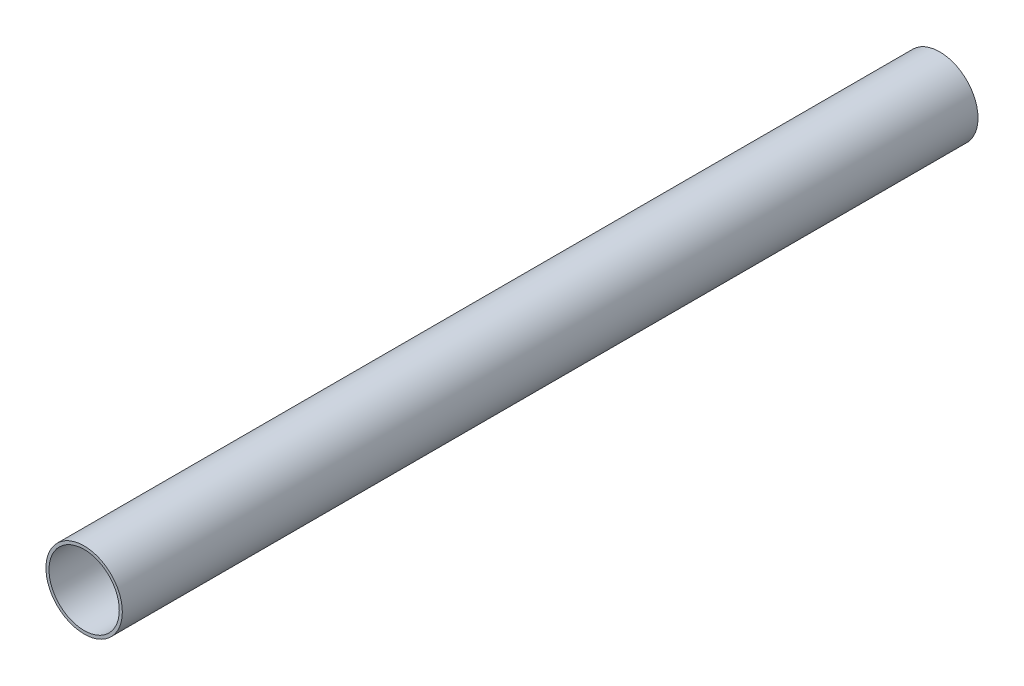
ISO-10303-21;
HEADER;
FILE_DESCRIPTION(('STEP AP214'),'2;1');
FILE_NAME('part.step','',(''),(''),'','','');
FILE_SCHEMA(('AUTOMOTIVE_DESIGN { 1 0 10303 214 1 1 1 1 }'));
ENDSEC;
DATA;
#1=APPLICATION_CONTEXT('core data for automotive mechanical design processes');
#2=APPLICATION_PROTOCOL_DEFINITION('international standard','automotive_design',2000,#1);
#3=PRODUCT_CONTEXT('',#1,'mechanical');
#4=PRODUCT('Part','Part','',(#3));
#5=PRODUCT_RELATED_PRODUCT_CATEGORY('part','',(#4));
#6=PRODUCT_DEFINITION_FORMATION('','',#4);
#7=PRODUCT_DEFINITION_CONTEXT('part definition',#1,'design');
#8=PRODUCT_DEFINITION('design','',#6,#7);
#9=PRODUCT_DEFINITION_SHAPE('','',#8);
#10=(LENGTH_UNIT() NAMED_UNIT(*) SI_UNIT(.MILLI.,.METRE.));
#11=(NAMED_UNIT(*) PLANE_ANGLE_UNIT() SI_UNIT($,.RADIAN.));
#12=(NAMED_UNIT(*) SI_UNIT($,.STERADIAN.) SOLID_ANGLE_UNIT());
#13=UNCERTAINTY_MEASURE_WITH_UNIT(LENGTH_MEASURE(1.E-05),#10,'distance_accuracy_value','');
#14=(GEOMETRIC_REPRESENTATION_CONTEXT(3) GLOBAL_UNCERTAINTY_ASSIGNED_CONTEXT((#13)) GLOBAL_UNIT_ASSIGNED_CONTEXT((#10,
#11,#12)) REPRESENTATION_CONTEXT('',''));
#15=CARTESIAN_POINT('',(0.,0.,0.));
#16=DIRECTION('',(0.,0.,1.));
#17=DIRECTION('',(1.,0.,0.));
#18=AXIS2_PLACEMENT_3D('',#15,#16,#17);
#19=CARTESIAN_POINT('',(0.,0.,280.));
#20=DIRECTION('',(0.,0.,1.));
#21=DIRECTION('',(1.,0.,0.));
#22=AXIS2_PLACEMENT_3D('',#19,#20,#21);
#23=PLANE('',#22);
#24=CARTESIAN_POINT('',(0.,0.,280.));
#25=DIRECTION('',(0.,0.,1.));
#26=DIRECTION('',(1.,0.,0.));
#27=AXIS2_PLACEMENT_3D('',#24,#25,#26);
#28=CIRCLE('',#27,12.5);
#29=CARTESIAN_POINT('',(12.5,0.,280.));
#30=VERTEX_POINT('',#29);
#31=EDGE_CURVE('E10',#30,#30,#28,.T.);
#32=ORIENTED_EDGE('',*,*,#31,.T.);
#33=EDGE_LOOP('',(#32));
#34=FACE_BOUND('',#33,.T.);
#35=CARTESIAN_POINT('',(0.,0.,280.));
#36=DIRECTION('',(0.,0.,1.));
#37=DIRECTION('',(1.,0.,0.));
#38=AXIS2_PLACEMENT_3D('',#35,#36,#37);
#39=CIRCLE('',#38,11.5);
#40=CARTESIAN_POINT('',(11.5,0.,280.));
#41=VERTEX_POINT('',#40);
#42=EDGE_CURVE('E41',#41,#41,#39,.T.);
#43=ORIENTED_EDGE('',*,*,#42,.F.);
#44=EDGE_LOOP('',(#43));
#45=FACE_BOUND('',#44,.T.);
#46=ADVANCED_FACE('F30',(#34,#45),#23,.T.);
#47=CARTESIAN_POINT('',(0.,0.,0.));
#48=DIRECTION('',(0.,0.,1.));
#49=DIRECTION('',(1.,0.,0.));
#50=AXIS2_PLACEMENT_3D('',#47,#48,#49);
#51=PLANE('',#50);
#52=CARTESIAN_POINT('',(0.,0.,0.));
#53=DIRECTION('',(0.,0.,1.));
#54=DIRECTION('',(1.,0.,0.));
#55=AXIS2_PLACEMENT_3D('',#52,#53,#54);
#56=CIRCLE('',#55,12.5);
#57=CARTESIAN_POINT('',(12.5,0.,0.));
#58=VERTEX_POINT('',#57);
#59=EDGE_CURVE('E37',#58,#58,#56,.T.);
#60=ORIENTED_EDGE('',*,*,#59,.F.);
#61=EDGE_LOOP('',(#60));
#62=FACE_BOUND('',#61,.T.);
#63=CARTESIAN_POINT('',(0.,0.,0.));
#64=DIRECTION('',(0.,0.,1.));
#65=DIRECTION('',(1.,0.,0.));
#66=AXIS2_PLACEMENT_3D('',#63,#64,#65);
#67=CIRCLE('',#66,11.5);
#68=CARTESIAN_POINT('',(11.5,0.,0.));
#69=VERTEX_POINT('',#68);
#70=EDGE_CURVE('E45',#69,#69,#67,.T.);
#71=ORIENTED_EDGE('',*,*,#70,.T.);
#72=EDGE_LOOP('',(#71));
#73=FACE_BOUND('',#72,.T.);
#74=ADVANCED_FACE('F54',(#62,#73),#51,.F.);
#75=CARTESIAN_POINT('',(0.,0.,280.));
#76=DIRECTION('',(0.,0.,-1.));
#77=DIRECTION('',(-1.,0.,0.));
#78=AXIS2_PLACEMENT_3D('',#75,#76,#77);
#79=CYLINDRICAL_SURFACE('',#78,12.5);
#80=ORIENTED_EDGE('',*,*,#31,.F.);
#81=EDGE_LOOP('',(#80));
#82=FACE_BOUND('',#81,.T.);
#83=ORIENTED_EDGE('',*,*,#59,.T.);
#84=EDGE_LOOP('',(#83));
#85=FACE_BOUND('',#84,.T.);
#86=ADVANCED_FACE('F32',(#82,#85),#79,.T.);
#87=CARTESIAN_POINT('',(0.,0.,280.));
#88=DIRECTION('',(0.,0.,-1.));
#89=DIRECTION('',(-1.,0.,0.));
#90=AXIS2_PLACEMENT_3D('',#87,#88,#89);
#91=CYLINDRICAL_SURFACE('',#90,11.5);
#92=ORIENTED_EDGE('',*,*,#42,.T.);
#93=EDGE_LOOP('',(#92));
#94=FACE_BOUND('',#93,.T.);
#95=ORIENTED_EDGE('',*,*,#70,.F.);
#96=EDGE_LOOP('',(#95));
#97=FACE_BOUND('',#96,.T.);
#98=ADVANCED_FACE('F56',(#94,#97),#91,.F.);
#99=CLOSED_SHELL('',(#46,#74,#86,#98));
#100=MANIFOLD_SOLID_BREP('B2',#99);
#101=ADVANCED_BREP_SHAPE_REPRESENTATION('',(#18,#100),#14);
#102=SHAPE_DEFINITION_REPRESENTATION(#9,#101);
ENDSEC;
END-ISO-10303-21;
